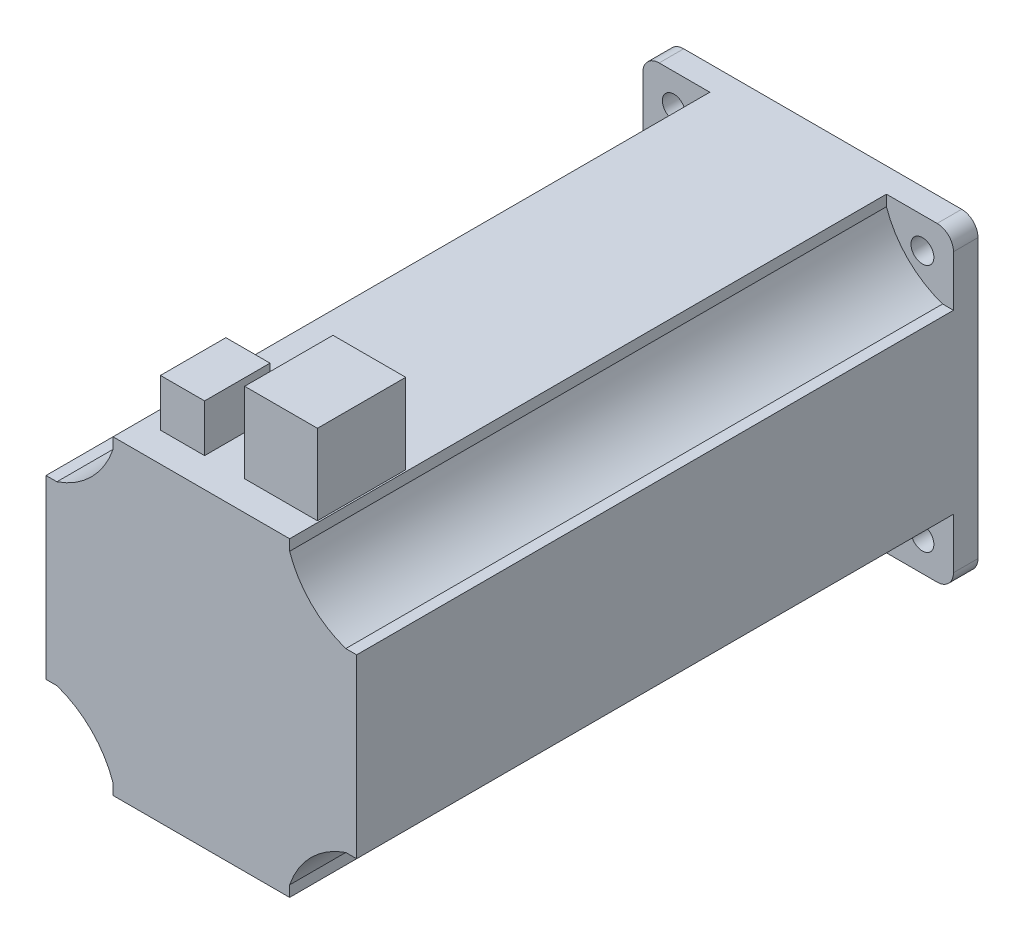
ISO-10303-21;
HEADER;
FILE_DESCRIPTION(('STEP AP214'),'2;1');
FILE_NAME('part.step','',(''),(''),'','','');
FILE_SCHEMA(('AUTOMOTIVE_DESIGN { 1 0 10303 214 1 1 1 1 }'));
ENDSEC;
DATA;
#1=APPLICATION_CONTEXT('core data for automotive mechanical design processes');
#2=APPLICATION_PROTOCOL_DEFINITION('international standard','automotive_design',2000,#1);
#3=PRODUCT_CONTEXT('',#1,'mechanical');
#4=PRODUCT('Part','Part','',(#3));
#5=PRODUCT_RELATED_PRODUCT_CATEGORY('part','',(#4));
#6=PRODUCT_DEFINITION_FORMATION('','',#4);
#7=PRODUCT_DEFINITION_CONTEXT('part definition',#1,'design');
#8=PRODUCT_DEFINITION('design','',#6,#7);
#9=PRODUCT_DEFINITION_SHAPE('','',#8);
#10=(LENGTH_UNIT() NAMED_UNIT(*) SI_UNIT(.MILLI.,.METRE.));
#11=(NAMED_UNIT(*) PLANE_ANGLE_UNIT() SI_UNIT($,.RADIAN.));
#12=(NAMED_UNIT(*) SI_UNIT($,.STERADIAN.) SOLID_ANGLE_UNIT());
#13=UNCERTAINTY_MEASURE_WITH_UNIT(LENGTH_MEASURE(1.E-05),#10,'distance_accuracy_value','');
#14=(GEOMETRIC_REPRESENTATION_CONTEXT(3) GLOBAL_UNCERTAINTY_ASSIGNED_CONTEXT((#13)) GLOBAL_UNIT_ASSIGNED_CONTEXT((#10,
#11,#12)) REPRESENTATION_CONTEXT('',''));
#15=CARTESIAN_POINT('',(0.,0.,0.));
#16=DIRECTION('',(0.,0.,1.));
#17=DIRECTION('',(1.,0.,0.));
#18=AXIS2_PLACEMENT_3D('',#15,#16,#17);
#19=CARTESIAN_POINT('',(-85.,95.,380.));
#20=DIRECTION('',(0.,-1.,0.));
#21=DIRECTION('',(1.,0.,0.));
#22=AXIS2_PLACEMENT_3D('',#19,#20,#21);
#23=PLANE('',#22);
#24=DIRECTION('',(0.,0.,-1.));
#25=VECTOR('',#24,1.);
#26=CARTESIAN_POINT('',(52.9999999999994,95.,308.));
#27=LINE('',#26,#25);
#28=CARTESIAN_POINT('',(52.9999999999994,95.,362.));
#29=VERTEX_POINT('',#28);
#30=CARTESIAN_POINT('',(52.9999999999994,95.,308.));
#31=VERTEX_POINT('',#30);
#32=EDGE_CURVE('E253',#29,#31,#27,.T.);
#33=ORIENTED_EDGE('',*,*,#32,.F.);
#34=DIRECTION('',(1.,0.,0.));
#35=VECTOR('',#34,1.);
#36=CARTESIAN_POINT('',(52.9999999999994,95.,362.));
#37=LINE('',#36,#35);
#38=CARTESIAN_POINT('',(8.49999999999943,95.,362.));
#39=VERTEX_POINT('',#38);
#40=EDGE_CURVE('E262',#39,#29,#37,.T.);
#41=ORIENTED_EDGE('',*,*,#40,.F.);
#42=DIRECTION('',(0.,0.,1.));
#43=VECTOR('',#42,1.);
#44=CARTESIAN_POINT('',(8.49999999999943,95.,308.));
#45=LINE('',#44,#43);
#46=CARTESIAN_POINT('',(8.49999999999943,95.,308.));
#47=VERTEX_POINT('',#46);
#48=EDGE_CURVE('E259',#47,#39,#45,.T.);
#49=ORIENTED_EDGE('',*,*,#48,.F.);
#50=DIRECTION('',(-1.,0.,0.));
#51=VECTOR('',#50,1.);
#52=CARTESIAN_POINT('',(52.9999999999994,95.,308.));
#53=LINE('',#52,#51);
#54=EDGE_CURVE('E256',#31,#47,#53,.T.);
#55=ORIENTED_EDGE('',*,*,#54,.F.);
#56=EDGE_LOOP('',(#33,#41,#49,#55));
#57=FACE_BOUND('',#56,.T.);
#58=DIRECTION('',(0.,0.,-1.));
#59=VECTOR('',#58,1.);
#60=CARTESIAN_POINT('',(53.999999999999,95.,380.));
#61=LINE('',#60,#59);
#62=CARTESIAN_POINT('',(53.999999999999,95.,380.));
#63=VERTEX_POINT('',#62);
#64=CARTESIAN_POINT('',(53.999999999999,95.,15.));
#65=VERTEX_POINT('',#64);
#66=EDGE_CURVE('E314',#63,#65,#61,.T.);
#67=ORIENTED_EDGE('',*,*,#66,.T.);
#68=DIRECTION('',(-1.,0.,0.));
#69=VECTOR('',#68,1.);
#70=CARTESIAN_POINT('',(84.999999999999,95.,15.));
#71=LINE('',#70,#69);
#72=CARTESIAN_POINT('',(84.999999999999,95.,15.));
#73=VERTEX_POINT('',#72);
#74=EDGE_CURVE('E301',#73,#65,#71,.T.);
#75=ORIENTED_EDGE('',*,*,#74,.F.);
#76=DIRECTION('',(0.,0.,-1.));
#77=VECTOR('',#76,1.);
#78=CARTESIAN_POINT('',(85.,95.,380.));
#79=LINE('',#78,#77);
#80=CARTESIAN_POINT('',(85.,95.,0.));
#81=VERTEX_POINT('',#80);
#82=EDGE_CURVE('E463',#73,#81,#79,.T.);
#83=ORIENTED_EDGE('',*,*,#82,.T.);
#84=DIRECTION('',(-1.,0.,0.));
#85=VECTOR('',#84,1.);
#86=CARTESIAN_POINT('',(-85.,95.,0.));
#87=LINE('',#86,#85);
#88=CARTESIAN_POINT('',(-85.,95.,0.));
#89=VERTEX_POINT('',#88);
#90=EDGE_CURVE('E447',#81,#89,#87,.T.);
#91=ORIENTED_EDGE('',*,*,#90,.T.);
#92=DIRECTION('',(0.,0.,-1.));
#93=VECTOR('',#92,1.);
#94=CARTESIAN_POINT('',(-85.,95.,380.));
#95=LINE('',#94,#93);
#96=CARTESIAN_POINT('',(-85.,95.,15.));
#97=VERTEX_POINT('',#96);
#98=EDGE_CURVE('E461',#97,#89,#95,.T.);
#99=ORIENTED_EDGE('',*,*,#98,.F.);
#100=DIRECTION('',(-1.,0.,0.));
#101=VECTOR('',#100,1.);
#102=CARTESIAN_POINT('',(-54.,95.,15.));
#103=LINE('',#102,#101);
#104=CARTESIAN_POINT('',(-54.,95.,15.));
#105=VERTEX_POINT('',#104);
#106=EDGE_CURVE('E390',#105,#97,#103,.T.);
#107=ORIENTED_EDGE('',*,*,#106,.F.);
#108=DIRECTION('',(0.,0.,-1.));
#109=VECTOR('',#108,1.);
#110=CARTESIAN_POINT('',(-54.,95.,380.));
#111=LINE('',#110,#109);
#112=CARTESIAN_POINT('',(-54.,95.,380.));
#113=VERTEX_POINT('',#112);
#114=EDGE_CURVE('E411',#113,#105,#111,.T.);
#115=ORIENTED_EDGE('',*,*,#114,.F.);
#116=DIRECTION('',(-1.,0.,0.));
#117=VECTOR('',#116,1.);
#118=CARTESIAN_POINT('',(-85.,95.,380.));
#119=LINE('',#118,#117);
#120=EDGE_CURVE('E459',#63,#113,#119,.T.);
#121=ORIENTED_EDGE('',*,*,#120,.F.);
#122=EDGE_LOOP('',(#67,#75,#83,#91,#99,#107,#115,#121));
#123=FACE_BOUND('',#122,.T.);
#124=DIRECTION('',(0.,0.,-1.));
#125=VECTOR('',#124,1.);
#126=CARTESIAN_POINT('',(-16.,95.,362.));
#127=LINE('',#126,#125);
#128=CARTESIAN_POINT('',(-16.,95.,362.));
#129=VERTEX_POINT('',#128);
#130=CARTESIAN_POINT('',(-16.,95.,322.));
#131=VERTEX_POINT('',#130);
#132=EDGE_CURVE('E220',#129,#131,#127,.T.);
#133=ORIENTED_EDGE('',*,*,#132,.F.);
#134=DIRECTION('',(1.,0.,0.));
#135=VECTOR('',#134,1.);
#136=CARTESIAN_POINT('',(-16.,95.,362.));
#137=LINE('',#136,#135);
#138=CARTESIAN_POINT('',(-43.,95.,362.));
#139=VERTEX_POINT('',#138);
#140=EDGE_CURVE('E222',#139,#129,#137,.T.);
#141=ORIENTED_EDGE('',*,*,#140,.F.);
#142=DIRECTION('',(0.,0.,1.));
#143=VECTOR('',#142,1.);
#144=CARTESIAN_POINT('',(-43.,95.,362.));
#145=LINE('',#144,#143);
#146=CARTESIAN_POINT('',(-43.,95.,322.));
#147=VERTEX_POINT('',#146);
#148=EDGE_CURVE('E35',#147,#139,#145,.T.);
#149=ORIENTED_EDGE('',*,*,#148,.F.);
#150=DIRECTION('',(-1.,0.,0.));
#151=VECTOR('',#150,1.);
#152=CARTESIAN_POINT('',(-16.,95.,322.));
#153=LINE('',#152,#151);
#154=EDGE_CURVE('E30',#131,#147,#153,.T.);
#155=ORIENTED_EDGE('',*,*,#154,.F.);
#156=EDGE_LOOP('',(#133,#141,#149,#155));
#157=FACE_BOUND('',#156,.T.);
#158=ADVANCED_FACE('F15',(#57,#123,#157),#23,.F.);
#159=CARTESIAN_POINT('',(-85.,85.,380.));
#160=DIRECTION('',(0.,0.,-1.));
#161=DIRECTION('',(-1.,0.,0.));
#162=AXIS2_PLACEMENT_3D('',#159,#160,#161);
#163=PLANE('',#162);
#164=DIRECTION('',(1.,0.,0.));
#165=VECTOR('',#164,1.);
#166=CARTESIAN_POINT('',(88.3423083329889,54.000000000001,380.));
#167=LINE('',#166,#165);
#168=CARTESIAN_POINT('',(88.3423083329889,54.000000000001,380.));
#169=VERTEX_POINT('',#168);
#170=CARTESIAN_POINT('',(95.,54.000000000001,380.));
#171=VERTEX_POINT('',#170);
#172=EDGE_CURVE('E307',#169,#171,#167,.T.);
#173=ORIENTED_EDGE('',*,*,#172,.F.);
#174=CARTESIAN_POINT('',(106.066017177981,106.066017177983,380.));
#175=DIRECTION('',(0.,0.,1.));
#176=DIRECTION('',(0.,-1.,0.));
#177=AXIS2_PLACEMENT_3D('',#174,#175,#176);
#178=CIRCLE('',#177,55.);
#179=CARTESIAN_POINT('',(53.9999999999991,88.34230833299,380.));
#180=VERTEX_POINT('',#179);
#181=EDGE_CURVE('E305',#180,#169,#178,.T.);
#182=ORIENTED_EDGE('',*,*,#181,.F.);
#183=DIRECTION('',(0.,-1.,0.));
#184=VECTOR('',#183,1.);
#185=CARTESIAN_POINT('',(53.9999999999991,88.34230833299,380.));
#186=LINE('',#185,#184);
#187=EDGE_CURVE('E309',#63,#180,#186,.T.);
#188=ORIENTED_EDGE('',*,*,#187,.F.);
#189=ORIENTED_EDGE('',*,*,#120,.T.);
#190=DIRECTION('',(0.,1.,0.));
#191=VECTOR('',#190,1.);
#192=CARTESIAN_POINT('',(-54.,88.3423083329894,380.));
#193=LINE('',#192,#191);
#194=CARTESIAN_POINT('',(-54.,88.3423083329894,380.));
#195=VERTEX_POINT('',#194);
#196=EDGE_CURVE('E400',#195,#113,#193,.T.);
#197=ORIENTED_EDGE('',*,*,#196,.F.);
#198=CARTESIAN_POINT('',(-106.066017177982,106.066017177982,380.));
#199=DIRECTION('',(0.,0.,1.));
#200=DIRECTION('',(1.,0.,0.));
#201=AXIS2_PLACEMENT_3D('',#198,#199,#200);
#202=CIRCLE('',#201,55.);
#203=CARTESIAN_POINT('',(-88.3423083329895,54.,380.));
#204=VERTEX_POINT('',#203);
#205=EDGE_CURVE('E398',#204,#195,#202,.T.);
#206=ORIENTED_EDGE('',*,*,#205,.F.);
#207=DIRECTION('',(1.,0.,0.));
#208=VECTOR('',#207,1.);
#209=CARTESIAN_POINT('',(-88.3423083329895,54.,380.));
#210=LINE('',#209,#208);
#211=CARTESIAN_POINT('',(-95.,54.,380.));
#212=VERTEX_POINT('',#211);
#213=EDGE_CURVE('E403',#212,#204,#210,.T.);
#214=ORIENTED_EDGE('',*,*,#213,.F.);
#215=DIRECTION('',(0.,-1.,0.));
#216=VECTOR('',#215,1.);
#217=CARTESIAN_POINT('',(-95.,85.,380.));
#218=LINE('',#217,#216);
#219=CARTESIAN_POINT('',(-95.,-54.,380.));
#220=VERTEX_POINT('',#219);
#221=EDGE_CURVE('E450',#212,#220,#218,.T.);
#222=ORIENTED_EDGE('',*,*,#221,.T.);
#223=DIRECTION('',(-1.,0.,0.));
#224=VECTOR('',#223,1.);
#225=CARTESIAN_POINT('',(-88.3423083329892,-54.,380.));
#226=LINE('',#225,#224);
#227=CARTESIAN_POINT('',(-88.3423083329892,-54.,380.));
#228=VERTEX_POINT('',#227);
#229=EDGE_CURVE('E369',#228,#220,#226,.T.);
#230=ORIENTED_EDGE('',*,*,#229,.F.);
#231=CARTESIAN_POINT('',(-106.066017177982,-106.066017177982,380.));
#232=DIRECTION('',(0.,0.,1.));
#233=DIRECTION('',(0.,1.,0.));
#234=AXIS2_PLACEMENT_3D('',#231,#232,#233);
#235=CIRCLE('',#234,55.);
#236=CARTESIAN_POINT('',(-54.,-88.3423083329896,380.));
#237=VERTEX_POINT('',#236);
#238=EDGE_CURVE('E367',#237,#228,#235,.T.);
#239=ORIENTED_EDGE('',*,*,#238,.F.);
#240=DIRECTION('',(0.,1.,0.));
#241=VECTOR('',#240,1.);
#242=CARTESIAN_POINT('',(-54.,-88.3423083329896,380.));
#243=LINE('',#242,#241);
#244=CARTESIAN_POINT('',(-54.,-95.,380.));
#245=VERTEX_POINT('',#244);
#246=EDGE_CURVE('E371',#245,#237,#243,.T.);
#247=ORIENTED_EDGE('',*,*,#246,.F.);
#248=DIRECTION('',(1.,0.,0.));
#249=VECTOR('',#248,1.);
#250=CARTESIAN_POINT('',(-85.,-95.,380.));
#251=LINE('',#250,#249);
#252=CARTESIAN_POINT('',(54.0000000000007,-95.,380.));
#253=VERTEX_POINT('',#252);
#254=EDGE_CURVE('E453',#245,#253,#251,.T.);
#255=ORIENTED_EDGE('',*,*,#254,.T.);
#256=DIRECTION('',(0.,-1.,0.));
#257=VECTOR('',#256,1.);
#258=CARTESIAN_POINT('',(54.0000000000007,-88.3423083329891,380.));
#259=LINE('',#258,#257);
#260=CARTESIAN_POINT('',(54.0000000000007,-88.3423083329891,380.));
#261=VERTEX_POINT('',#260);
#262=EDGE_CURVE('E338',#261,#253,#259,.T.);
#263=ORIENTED_EDGE('',*,*,#262,.F.);
#264=CARTESIAN_POINT('',(106.066017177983,-106.066017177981,380.));
#265=DIRECTION('',(0.,0.,1.));
#266=DIRECTION('',(-1.,0.,0.));
#267=AXIS2_PLACEMENT_3D('',#264,#265,#266);
#268=CIRCLE('',#267,55.);
#269=CARTESIAN_POINT('',(88.3423083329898,-53.9999999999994,380.));
#270=VERTEX_POINT('',#269);
#271=EDGE_CURVE('E336',#270,#261,#268,.T.);
#272=ORIENTED_EDGE('',*,*,#271,.F.);
#273=DIRECTION('',(-1.,0.,0.));
#274=VECTOR('',#273,1.);
#275=CARTESIAN_POINT('',(88.3423083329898,-53.9999999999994,380.));
#276=LINE('',#275,#274);
#277=CARTESIAN_POINT('',(95.,-53.9999999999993,380.));
#278=VERTEX_POINT('',#277);
#279=EDGE_CURVE('E340',#278,#270,#276,.T.);
#280=ORIENTED_EDGE('',*,*,#279,.F.);
#281=DIRECTION('',(0.,1.,0.));
#282=VECTOR('',#281,1.);
#283=CARTESIAN_POINT('',(95.,85.,380.));
#284=LINE('',#283,#282);
#285=EDGE_CURVE('E456',#278,#171,#284,.T.);
#286=ORIENTED_EDGE('',*,*,#285,.T.);
#287=EDGE_LOOP('',(#173,#182,#188,#189,#197,#206,#214,#222,#230,#239,#247,#255,#263,#272,#280,#286));
#288=FACE_BOUND('',#287,.T.);
#289=ADVANCED_FACE('F533',(#288),#163,.F.);
#290=CARTESIAN_POINT('',(95.,85.,380.));
#291=DIRECTION('',(-1.,0.,0.));
#292=DIRECTION('',(0.,-1.,0.));
#293=AXIS2_PLACEMENT_3D('',#290,#291,#292);
#294=PLANE('',#293);
#295=DIRECTION('',(0.,0.,-1.));
#296=VECTOR('',#295,1.);
#297=CARTESIAN_POINT('',(95.,54.000000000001,380.));
#298=LINE('',#297,#296);
#299=CARTESIAN_POINT('',(95.,54.000000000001,15.));
#300=VERTEX_POINT('',#299);
#301=EDGE_CURVE('E317',#171,#300,#298,.T.);
#302=ORIENTED_EDGE('',*,*,#301,.F.);
#303=ORIENTED_EDGE('',*,*,#285,.F.);
#304=DIRECTION('',(0.,0.,-1.));
#305=VECTOR('',#304,1.);
#306=CARTESIAN_POINT('',(95.,-53.9999999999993,380.));
#307=LINE('',#306,#305);
#308=CARTESIAN_POINT('',(95.,-53.9999999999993,15.));
#309=VERTEX_POINT('',#308);
#310=EDGE_CURVE('E345',#278,#309,#307,.T.);
#311=ORIENTED_EDGE('',*,*,#310,.T.);
#312=DIRECTION('',(0.,1.,0.));
#313=VECTOR('',#312,1.);
#314=CARTESIAN_POINT('',(95.,-85.,15.));
#315=LINE('',#314,#313);
#316=CARTESIAN_POINT('',(95.,-85.,15.));
#317=VERTEX_POINT('',#316);
#318=EDGE_CURVE('E332',#317,#309,#315,.T.);
#319=ORIENTED_EDGE('',*,*,#318,.F.);
#320=DIRECTION('',(0.,0.,-1.));
#321=VECTOR('',#320,1.);
#322=CARTESIAN_POINT('',(95.,-85.,380.));
#323=LINE('',#322,#321);
#324=CARTESIAN_POINT('',(95.,-85.,0.));
#325=VERTEX_POINT('',#324);
#326=EDGE_CURVE('E467',#317,#325,#323,.T.);
#327=ORIENTED_EDGE('',*,*,#326,.T.);
#328=DIRECTION('',(0.,1.,0.));
#329=VECTOR('',#328,1.);
#330=CARTESIAN_POINT('',(95.,85.,0.));
#331=LINE('',#330,#329);
#332=CARTESIAN_POINT('',(95.,85.,0.));
#333=VERTEX_POINT('',#332);
#334=EDGE_CURVE('E441',#325,#333,#331,.T.);
#335=ORIENTED_EDGE('',*,*,#334,.T.);
#336=DIRECTION('',(0.,0.,-1.));
#337=VECTOR('',#336,1.);
#338=CARTESIAN_POINT('',(95.,85.,380.));
#339=LINE('',#338,#337);
#340=CARTESIAN_POINT('',(95.,85.,15.));
#341=VERTEX_POINT('',#340);
#342=EDGE_CURVE('E465',#341,#333,#339,.T.);
#343=ORIENTED_EDGE('',*,*,#342,.F.);
#344=DIRECTION('',(0.,1.,0.));
#345=VECTOR('',#344,1.);
#346=CARTESIAN_POINT('',(95.,54.000000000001,15.));
#347=LINE('',#346,#345);
#348=EDGE_CURVE('E297',#300,#341,#347,.T.);
#349=ORIENTED_EDGE('',*,*,#348,.F.);
#350=EDGE_LOOP('',(#302,#303,#311,#319,#327,#335,#343,#349));
#351=FACE_BOUND('',#350,.T.);
#352=ADVANCED_FACE('F505',(#351),#294,.F.);
#353=CARTESIAN_POINT('',(85.,85.,380.));
#354=DIRECTION('',(0.,0.,-1.));
#355=DIRECTION('',(-1.,0.,0.));
#356=AXIS2_PLACEMENT_3D('',#353,#354,#355);
#357=CYLINDRICAL_SURFACE('',#356,10.);
#358=CARTESIAN_POINT('',(84.9999999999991,85.,15.));
#359=DIRECTION('',(0.,0.,1.));
#360=DIRECTION('',(0.,-1.,0.));
#361=AXIS2_PLACEMENT_3D('',#358,#359,#360);
#362=CIRCLE('',#361,10.);
#363=EDGE_CURVE('E299',#341,#73,#362,.T.);
#364=ORIENTED_EDGE('',*,*,#363,.F.);
#365=ORIENTED_EDGE('',*,*,#342,.T.);
#366=CARTESIAN_POINT('',(85.,85.,0.));
#367=DIRECTION('',(0.,0.,1.));
#368=DIRECTION('',(-1.,0.,0.));
#369=AXIS2_PLACEMENT_3D('',#366,#367,#368);
#370=CIRCLE('',#369,10.);
#371=EDGE_CURVE('E444',#333,#81,#370,.T.);
#372=ORIENTED_EDGE('',*,*,#371,.T.);
#373=ORIENTED_EDGE('',*,*,#82,.F.);
#374=EDGE_LOOP('',(#364,#365,#372,#373));
#375=FACE_BOUND('',#374,.T.);
#376=ADVANCED_FACE('F500',(#375),#357,.T.);
#377=CARTESIAN_POINT('',(-85.,-95.,380.));
#378=DIRECTION('',(0.,1.,0.));
#379=DIRECTION('',(-1.,0.,0.));
#380=AXIS2_PLACEMENT_3D('',#377,#378,#379);
#381=PLANE('',#380);
#382=DIRECTION('',(0.,0.,-1.));
#383=VECTOR('',#382,1.);
#384=CARTESIAN_POINT('',(54.0000000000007,-95.,380.));
#385=LINE('',#384,#383);
#386=CARTESIAN_POINT('',(54.0000000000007,-95.,15.));
#387=VERTEX_POINT('',#386);
#388=EDGE_CURVE('E348',#253,#387,#385,.T.);
#389=ORIENTED_EDGE('',*,*,#388,.F.);
#390=ORIENTED_EDGE('',*,*,#254,.F.);
#391=DIRECTION('',(0.,0.,-1.));
#392=VECTOR('',#391,1.);
#393=CARTESIAN_POINT('',(-54.,-95.,380.));
#394=LINE('',#393,#392);
#395=CARTESIAN_POINT('',(-54.,-95.,15.));
#396=VERTEX_POINT('',#395);
#397=EDGE_CURVE('E376',#245,#396,#394,.T.);
#398=ORIENTED_EDGE('',*,*,#397,.T.);
#399=DIRECTION('',(1.,0.,0.));
#400=VECTOR('',#399,1.);
#401=CARTESIAN_POINT('',(-85.,-95.,15.));
#402=LINE('',#401,#400);
#403=CARTESIAN_POINT('',(-85.,-95.,15.));
#404=VERTEX_POINT('',#403);
#405=EDGE_CURVE('E363',#404,#396,#402,.T.);
#406=ORIENTED_EDGE('',*,*,#405,.F.);
#407=DIRECTION('',(0.,0.,-1.));
#408=VECTOR('',#407,1.);
#409=CARTESIAN_POINT('',(-85.,-95.,380.));
#410=LINE('',#409,#408);
#411=CARTESIAN_POINT('',(-85.,-95.,0.));
#412=VERTEX_POINT('',#411);
#413=EDGE_CURVE('E471',#404,#412,#410,.T.);
#414=ORIENTED_EDGE('',*,*,#413,.T.);
#415=DIRECTION('',(1.,0.,0.));
#416=VECTOR('',#415,1.);
#417=CARTESIAN_POINT('',(-85.,-95.,0.));
#418=LINE('',#417,#416);
#419=CARTESIAN_POINT('',(85.,-95.,0.));
#420=VERTEX_POINT('',#419);
#421=EDGE_CURVE('E435',#412,#420,#418,.T.);
#422=ORIENTED_EDGE('',*,*,#421,.T.);
#423=DIRECTION('',(0.,0.,-1.));
#424=VECTOR('',#423,1.);
#425=CARTESIAN_POINT('',(85.,-95.,380.));
#426=LINE('',#425,#424);
#427=CARTESIAN_POINT('',(85.,-95.,15.));
#428=VERTEX_POINT('',#427);
#429=EDGE_CURVE('E469',#428,#420,#426,.T.);
#430=ORIENTED_EDGE('',*,*,#429,.F.);
#431=DIRECTION('',(1.,0.,0.));
#432=VECTOR('',#431,1.);
#433=CARTESIAN_POINT('',(54.0000000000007,-95.,15.));
#434=LINE('',#433,#432);
#435=EDGE_CURVE('E328',#387,#428,#434,.T.);
#436=ORIENTED_EDGE('',*,*,#435,.F.);
#437=EDGE_LOOP('',(#389,#390,#398,#406,#414,#422,#430,#436));
#438=FACE_BOUND('',#437,.T.);
#439=ADVANCED_FACE('F514',(#438),#381,.F.);
#440=CARTESIAN_POINT('',(85.,-85.,380.));
#441=DIRECTION('',(0.,0.,-1.));
#442=DIRECTION('',(-1.,0.,0.));
#443=AXIS2_PLACEMENT_3D('',#440,#441,#442);
#444=CYLINDRICAL_SURFACE('',#443,10.);
#445=CARTESIAN_POINT('',(85.,-85.,15.));
#446=DIRECTION('',(0.,0.,1.));
#447=DIRECTION('',(-1.,0.,0.));
#448=AXIS2_PLACEMENT_3D('',#445,#446,#447);
#449=CIRCLE('',#448,10.);
#450=EDGE_CURVE('E330',#428,#317,#449,.T.);
#451=ORIENTED_EDGE('',*,*,#450,.F.);
#452=ORIENTED_EDGE('',*,*,#429,.T.);
#453=CARTESIAN_POINT('',(85.,-85.,0.));
#454=DIRECTION('',(0.,0.,1.));
#455=DIRECTION('',(-1.,0.,0.));
#456=AXIS2_PLACEMENT_3D('',#453,#454,#455);
#457=CIRCLE('',#456,10.);
#458=EDGE_CURVE('E438',#420,#325,#457,.T.);
#459=ORIENTED_EDGE('',*,*,#458,.T.);
#460=ORIENTED_EDGE('',*,*,#326,.F.);
#461=EDGE_LOOP('',(#451,#452,#459,#460));
#462=FACE_BOUND('',#461,.T.);
#463=ADVANCED_FACE('F510',(#462),#444,.T.);
#464=CARTESIAN_POINT('',(-95.,85.,380.));
#465=DIRECTION('',(1.,0.,0.));
#466=DIRECTION('',(0.,0.,-1.));
#467=AXIS2_PLACEMENT_3D('',#464,#465,#466);
#468=PLANE('',#467);
#469=DIRECTION('',(0.,0.,-1.));
#470=VECTOR('',#469,1.);
#471=CARTESIAN_POINT('',(-95.,-54.,380.));
#472=LINE('',#471,#470);
#473=CARTESIAN_POINT('',(-95.,-54.,15.));
#474=VERTEX_POINT('',#473);
#475=EDGE_CURVE('E379',#220,#474,#472,.T.);
#476=ORIENTED_EDGE('',*,*,#475,.F.);
#477=ORIENTED_EDGE('',*,*,#221,.F.);
#478=DIRECTION('',(0.,0.,-1.));
#479=VECTOR('',#478,1.);
#480=CARTESIAN_POINT('',(-95.,54.,380.));
#481=LINE('',#480,#479);
#482=CARTESIAN_POINT('',(-95.,54.,15.));
#483=VERTEX_POINT('',#482);
#484=EDGE_CURVE('E408',#212,#483,#481,.T.);
#485=ORIENTED_EDGE('',*,*,#484,.T.);
#486=DIRECTION('',(0.,-1.,0.));
#487=VECTOR('',#486,1.);
#488=CARTESIAN_POINT('',(-95.,85.,15.));
#489=LINE('',#488,#487);
#490=CARTESIAN_POINT('',(-95.,85.,15.));
#491=VERTEX_POINT('',#490);
#492=EDGE_CURVE('E394',#491,#483,#489,.T.);
#493=ORIENTED_EDGE('',*,*,#492,.F.);
#494=DIRECTION('',(0.,0.,-1.));
#495=VECTOR('',#494,1.);
#496=CARTESIAN_POINT('',(-95.,85.,380.));
#497=LINE('',#496,#495);
#498=CARTESIAN_POINT('',(-95.,85.,0.));
#499=VERTEX_POINT('',#498);
#500=EDGE_CURVE('E23',#491,#499,#497,.T.);
#501=ORIENTED_EDGE('',*,*,#500,.T.);
#502=DIRECTION('',(0.,-1.,0.));
#503=VECTOR('',#502,1.);
#504=CARTESIAN_POINT('',(-95.,85.,0.));
#505=LINE('',#504,#503);
#506=CARTESIAN_POINT('',(-95.,-85.,0.));
#507=VERTEX_POINT('',#506);
#508=EDGE_CURVE('E429',#499,#507,#505,.T.);
#509=ORIENTED_EDGE('',*,*,#508,.T.);
#510=DIRECTION('',(0.,0.,-1.));
#511=VECTOR('',#510,1.);
#512=CARTESIAN_POINT('',(-95.,-85.,380.));
#513=LINE('',#512,#511);
#514=CARTESIAN_POINT('',(-95.,-85.,15.));
#515=VERTEX_POINT('',#514);
#516=EDGE_CURVE('E473',#515,#507,#513,.T.);
#517=ORIENTED_EDGE('',*,*,#516,.F.);
#518=DIRECTION('',(0.,-1.,0.));
#519=VECTOR('',#518,1.);
#520=CARTESIAN_POINT('',(-95.,-54.,15.));
#521=LINE('',#520,#519);
#522=EDGE_CURVE('E359',#474,#515,#521,.T.);
#523=ORIENTED_EDGE('',*,*,#522,.F.);
#524=EDGE_LOOP('',(#476,#477,#485,#493,#501,#509,#517,#523));
#525=FACE_BOUND('',#524,.T.);
#526=ADVANCED_FACE('F479',(#525),#468,.F.);
#527=CARTESIAN_POINT('',(-85.,-85.,380.));
#528=DIRECTION('',(0.,0.,-1.));
#529=DIRECTION('',(-1.,0.,0.));
#530=AXIS2_PLACEMENT_3D('',#527,#528,#529);
#531=CYLINDRICAL_SURFACE('',#530,10.);
#532=CARTESIAN_POINT('',(-85.,-85.,15.));
#533=DIRECTION('',(0.,0.,1.));
#534=DIRECTION('',(0.,1.,0.));
#535=AXIS2_PLACEMENT_3D('',#532,#533,#534);
#536=CIRCLE('',#535,10.);
#537=EDGE_CURVE('E361',#515,#404,#536,.T.);
#538=ORIENTED_EDGE('',*,*,#537,.F.);
#539=ORIENTED_EDGE('',*,*,#516,.T.);
#540=CARTESIAN_POINT('',(-85.,-85.,0.));
#541=DIRECTION('',(0.,0.,1.));
#542=DIRECTION('',(-1.,0.,0.));
#543=AXIS2_PLACEMENT_3D('',#540,#541,#542);
#544=CIRCLE('',#543,10.);
#545=EDGE_CURVE('E432',#507,#412,#544,.T.);
#546=ORIENTED_EDGE('',*,*,#545,.T.);
#547=ORIENTED_EDGE('',*,*,#413,.F.);
#548=EDGE_LOOP('',(#538,#539,#546,#547));
#549=FACE_BOUND('',#548,.T.);
#550=ADVANCED_FACE('F520',(#549),#531,.T.);
#551=CARTESIAN_POINT('',(-85.,85.,380.));
#552=DIRECTION('',(0.,0.,-1.));
#553=DIRECTION('',(-1.,0.,0.));
#554=AXIS2_PLACEMENT_3D('',#551,#552,#553);
#555=CYLINDRICAL_SURFACE('',#554,10.);
#556=CARTESIAN_POINT('',(-85.,85.,15.));
#557=DIRECTION('',(0.,0.,1.));
#558=DIRECTION('',(1.,0.,0.));
#559=AXIS2_PLACEMENT_3D('',#556,#557,#558);
#560=CIRCLE('',#559,10.);
#561=EDGE_CURVE('E392',#97,#491,#560,.T.);
#562=ORIENTED_EDGE('',*,*,#561,.F.);
#563=ORIENTED_EDGE('',*,*,#98,.T.);
#564=CARTESIAN_POINT('',(-85.,85.,0.));
#565=DIRECTION('',(0.,0.,1.));
#566=DIRECTION('',(-1.,0.,0.));
#567=AXIS2_PLACEMENT_3D('',#564,#565,#566);
#568=CIRCLE('',#567,10.);
#569=EDGE_CURVE('E426',#89,#499,#568,.T.);
#570=ORIENTED_EDGE('',*,*,#569,.T.);
#571=ORIENTED_EDGE('',*,*,#500,.F.);
#572=EDGE_LOOP('',(#562,#563,#570,#571));
#573=FACE_BOUND('',#572,.T.);
#574=ADVANCED_FACE('F17',(#573),#555,.T.);
#575=CARTESIAN_POINT('',(-85.,85.,0.));
#576=DIRECTION('',(0.,0.,-1.));
#577=DIRECTION('',(-1.,0.,0.));
#578=AXIS2_PLACEMENT_3D('',#575,#576,#577);
#579=PLANE('',#578);
#580=CARTESIAN_POINT('',(0.,0.,0.));
#581=DIRECTION('',(0.,0.,-1.));
#582=DIRECTION('',(-1.,0.,0.));
#583=AXIS2_PLACEMENT_3D('',#580,#581,#582);
#584=CIRCLE('',#583,75.);
#585=CARTESIAN_POINT('',(-75.,0.,0.));
#586=VERTEX_POINT('',#585);
#587=EDGE_CURVE('E10',#586,#586,#584,.F.);
#588=ORIENTED_EDGE('',*,*,#587,.F.);
#589=EDGE_LOOP('',(#588));
#590=FACE_BOUND('',#589,.T.);
#591=ADVANCED_FACE('F637',(#590),#579,.T.);
#592=CARTESIAN_POINT('',(76.0139789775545,-76.0139789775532,0.));
#593=DIRECTION('',(0.,0.,-1.));
#594=DIRECTION('',(-1.,0.,0.));
#595=AXIS2_PLACEMENT_3D('',#592,#593,#594);
#596=CIRCLE('',#595,7.);
#597=CARTESIAN_POINT('',(69.0139789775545,-76.0139789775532,0.));
#598=VERTEX_POINT('',#597);
#599=EDGE_CURVE('E947',#598,#598,#596,.T.);
#600=ORIENTED_EDGE('',*,*,#599,.F.);
#601=EDGE_LOOP('',(#600));
#602=FACE_BOUND('',#601,.T.);
#603=CARTESIAN_POINT('',(-76.0139789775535,-76.0139789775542,0.));
#604=DIRECTION('',(0.,0.,-1.));
#605=DIRECTION('',(-1.,0.,0.));
#606=AXIS2_PLACEMENT_3D('',#603,#604,#605);
#607=CIRCLE('',#606,7.);
#608=CARTESIAN_POINT('',(-83.0139789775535,-76.0139789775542,0.));
#609=VERTEX_POINT('',#608);
#610=EDGE_CURVE('E951',#609,#609,#607,.T.);
#611=ORIENTED_EDGE('',*,*,#610,.F.);
#612=EDGE_LOOP('',(#611));
#613=FACE_BOUND('',#612,.T.);
#614=CARTESIAN_POINT('',(-76.013978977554,76.0139789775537,0.));
#615=DIRECTION('',(0.,0.,-1.));
#616=DIRECTION('',(-1.,0.,0.));
#617=AXIS2_PLACEMENT_3D('',#614,#615,#616);
#618=CIRCLE('',#617,7.);
#619=CARTESIAN_POINT('',(-83.013978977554,76.0139789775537,0.));
#620=VERTEX_POINT('',#619);
#621=EDGE_CURVE('E960',#620,#620,#618,.T.);
#622=ORIENTED_EDGE('',*,*,#621,.F.);
#623=EDGE_LOOP('',(#622));
#624=FACE_BOUND('',#623,.T.);
#625=CARTESIAN_POINT('',(76.013978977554,76.0139789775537,0.));
#626=DIRECTION('',(0.,0.,-1.));
#627=DIRECTION('',(-1.,0.,0.));
#628=AXIS2_PLACEMENT_3D('',#625,#626,#627);
#629=CIRCLE('',#628,7.);
#630=CARTESIAN_POINT('',(69.013978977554,76.0139789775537,0.));
#631=VERTEX_POINT('',#630);
#632=EDGE_CURVE('E286',#631,#631,#629,.T.);
#633=ORIENTED_EDGE('',*,*,#632,.F.);
#634=EDGE_LOOP('',(#633));
#635=FACE_BOUND('',#634,.T.);
#636=ORIENTED_EDGE('',*,*,#569,.F.);
#637=ORIENTED_EDGE('',*,*,#90,.F.);
#638=ORIENTED_EDGE('',*,*,#371,.F.);
#639=ORIENTED_EDGE('',*,*,#334,.F.);
#640=ORIENTED_EDGE('',*,*,#458,.F.);
#641=ORIENTED_EDGE('',*,*,#421,.F.);
#642=ORIENTED_EDGE('',*,*,#545,.F.);
#643=ORIENTED_EDGE('',*,*,#508,.F.);
#644=EDGE_LOOP('',(#636,#637,#638,#639,#640,#641,#642,#643));
#645=FACE_BOUND('',#644,.T.);
#646=CARTESIAN_POINT('',(0.,0.,0.));
#647=DIRECTION('',(0.,0.,-1.));
#648=DIRECTION('',(-1.,0.,0.));
#649=AXIS2_PLACEMENT_3D('',#646,#647,#648);
#650=CIRCLE('',#649,80.);
#651=CARTESIAN_POINT('',(-80.,0.,0.));
#652=VERTEX_POINT('',#651);
#653=EDGE_CURVE('E420',#652,#652,#650,.T.);
#654=ORIENTED_EDGE('',*,*,#653,.F.);
#655=EDGE_LOOP('',(#654));
#656=FACE_BOUND('',#655,.T.);
#657=ADVANCED_FACE('F486',(#602,#613,#624,#635,#645,#656),#579,.T.);
#658=CARTESIAN_POINT('',(0.,0.,-5.));
#659=DIRECTION('',(0.,0.,-1.));
#660=DIRECTION('',(-1.,0.,0.));
#661=AXIS2_PLACEMENT_3D('',#658,#659,#660);
#662=PLANE('',#661);
#663=CARTESIAN_POINT('',(0.,0.,-5.));
#664=DIRECTION('',(0.,0.,-1.));
#665=DIRECTION('',(-1.,0.,0.));
#666=AXIS2_PLACEMENT_3D('',#663,#664,#665);
#667=CIRCLE('',#666,80.);
#668=CARTESIAN_POINT('',(-80.,0.,-5.));
#669=VERTEX_POINT('',#668);
#670=EDGE_CURVE('E423',#669,#669,#667,.T.);
#671=ORIENTED_EDGE('',*,*,#670,.T.);
#672=EDGE_LOOP('',(#671));
#673=FACE_BOUND('',#672,.T.);
#674=CARTESIAN_POINT('',(0.,0.,-5.));
#675=DIRECTION('',(0.,0.,-1.));
#676=DIRECTION('',(-1.,0.,0.));
#677=AXIS2_PLACEMENT_3D('',#674,#675,#676);
#678=CIRCLE('',#677,75.);
#679=CARTESIAN_POINT('',(-75.,0.,-5.));
#680=VERTEX_POINT('',#679);
#681=EDGE_CURVE('E417',#680,#680,#678,.T.);
#682=ORIENTED_EDGE('',*,*,#681,.F.);
#683=EDGE_LOOP('',(#682));
#684=FACE_BOUND('',#683,.T.);
#685=ADVANCED_FACE('F651',(#673,#684),#662,.T.);
#686=CARTESIAN_POINT('',(0.,0.,-5.));
#687=DIRECTION('',(0.,0.,1.));
#688=DIRECTION('',(1.,0.,0.));
#689=AXIS2_PLACEMENT_3D('',#686,#687,#688);
#690=CYLINDRICAL_SURFACE('',#689,80.);
#691=ORIENTED_EDGE('',*,*,#670,.F.);
#692=EDGE_LOOP('',(#691));
#693=FACE_BOUND('',#692,.T.);
#694=ORIENTED_EDGE('',*,*,#653,.T.);
#695=EDGE_LOOP('',(#694));
#696=FACE_BOUND('',#695,.T.);
#697=ADVANCED_FACE('F659',(#693,#696),#690,.T.);
#698=CARTESIAN_POINT('',(0.,0.,-5.));
#699=DIRECTION('',(0.,0.,1.));
#700=DIRECTION('',(1.,0.,0.));
#701=AXIS2_PLACEMENT_3D('',#698,#699,#700);
#702=CYLINDRICAL_SURFACE('',#701,75.);
#703=ORIENTED_EDGE('',*,*,#681,.T.);
#704=EDGE_LOOP('',(#703));
#705=FACE_BOUND('',#704,.T.);
#706=ORIENTED_EDGE('',*,*,#587,.T.);
#707=EDGE_LOOP('',(#706));
#708=FACE_BOUND('',#707,.T.);
#709=ADVANCED_FACE('F668',(#705,#708),#702,.F.);
#710=CARTESIAN_POINT('',(-106.066017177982,106.066017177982,380.));
#711=DIRECTION('',(0.,0.,-1.));
#712=DIRECTION('',(-1.,0.,0.));
#713=AXIS2_PLACEMENT_3D('',#710,#711,#712);
#714=CYLINDRICAL_SURFACE('',#713,55.);
#715=CARTESIAN_POINT('',(-106.066017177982,106.066017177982,15.));
#716=DIRECTION('',(0.,0.,1.));
#717=DIRECTION('',(1.,0.,0.));
#718=AXIS2_PLACEMENT_3D('',#715,#716,#717);
#719=CIRCLE('',#718,55.);
#720=CARTESIAN_POINT('',(-88.3423083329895,54.,15.));
#721=VERTEX_POINT('',#720);
#722=CARTESIAN_POINT('',(-54.,88.3423083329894,15.));
#723=VERTEX_POINT('',#722);
#724=EDGE_CURVE('E385',#721,#723,#719,.T.);
#725=ORIENTED_EDGE('',*,*,#724,.F.);
#726=DIRECTION('',(0.,0.,-1.));
#727=VECTOR('',#726,1.);
#728=CARTESIAN_POINT('',(-88.3423083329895,54.,380.));
#729=LINE('',#728,#727);
#730=EDGE_CURVE('E405',#204,#721,#729,.T.);
#731=ORIENTED_EDGE('',*,*,#730,.F.);
#732=ORIENTED_EDGE('',*,*,#205,.T.);
#733=DIRECTION('',(0.,0.,-1.));
#734=VECTOR('',#733,1.);
#735=CARTESIAN_POINT('',(-54.,88.3423083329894,380.));
#736=LINE('',#735,#734);
#737=EDGE_CURVE('E414',#195,#723,#736,.T.);
#738=ORIENTED_EDGE('',*,*,#737,.T.);
#739=EDGE_LOOP('',(#725,#731,#732,#738));
#740=FACE_BOUND('',#739,.T.);
#741=ADVANCED_FACE('F677',(#740),#714,.F.);
#742=CARTESIAN_POINT('',(-54.,88.3423083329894,380.));
#743=DIRECTION('',(-1.,0.,0.));
#744=DIRECTION('',(0.,0.,1.));
#745=AXIS2_PLACEMENT_3D('',#742,#743,#744);
#746=PLANE('',#745);
#747=DIRECTION('',(0.,1.,0.));
#748=VECTOR('',#747,1.);
#749=CARTESIAN_POINT('',(-54.,88.3423083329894,15.));
#750=LINE('',#749,#748);
#751=EDGE_CURVE('E388',#723,#105,#750,.T.);
#752=ORIENTED_EDGE('',*,*,#751,.F.);
#753=ORIENTED_EDGE('',*,*,#737,.F.);
#754=ORIENTED_EDGE('',*,*,#196,.T.);
#755=ORIENTED_EDGE('',*,*,#114,.T.);
#756=EDGE_LOOP('',(#752,#753,#754,#755));
#757=FACE_BOUND('',#756,.T.);
#758=ADVANCED_FACE('F547',(#757),#746,.T.);
#759=CARTESIAN_POINT('',(-88.3423083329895,54.,380.));
#760=DIRECTION('',(0.,1.,0.));
#761=DIRECTION('',(0.,0.,1.));
#762=AXIS2_PLACEMENT_3D('',#759,#760,#761);
#763=PLANE('',#762);
#764=DIRECTION('',(1.,0.,0.));
#765=VECTOR('',#764,1.);
#766=CARTESIAN_POINT('',(-88.3423083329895,54.,15.));
#767=LINE('',#766,#765);
#768=EDGE_CURVE('E396',#483,#721,#767,.T.);
#769=ORIENTED_EDGE('',*,*,#768,.F.);
#770=ORIENTED_EDGE('',*,*,#484,.F.);
#771=ORIENTED_EDGE('',*,*,#213,.T.);
#772=ORIENTED_EDGE('',*,*,#730,.T.);
#773=EDGE_LOOP('',(#769,#770,#771,#772));
#774=FACE_BOUND('',#773,.T.);
#775=ADVANCED_FACE('F539',(#774),#763,.T.);
#776=CARTESIAN_POINT('',(-106.066017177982,106.066017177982,15.));
#777=DIRECTION('',(0.,0.,1.));
#778=DIRECTION('',(1.,0.,0.));
#779=AXIS2_PLACEMENT_3D('',#776,#777,#778);
#780=PLANE('',#779);
#781=CARTESIAN_POINT('',(-76.013978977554,76.0139789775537,15.));
#782=DIRECTION('',(0.,0.,1.));
#783=DIRECTION('',(1.,0.,0.));
#784=AXIS2_PLACEMENT_3D('',#781,#782,#783);
#785=CIRCLE('',#784,7.);
#786=CARTESIAN_POINT('',(-69.013978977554,76.0139789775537,15.));
#787=VERTEX_POINT('',#786);
#788=EDGE_CURVE('E226',#787,#787,#785,.T.);
#789=ORIENTED_EDGE('',*,*,#788,.F.);
#790=EDGE_LOOP('',(#789));
#791=FACE_BOUND('',#790,.T.);
#792=ORIENTED_EDGE('',*,*,#724,.T.);
#793=ORIENTED_EDGE('',*,*,#751,.T.);
#794=ORIENTED_EDGE('',*,*,#106,.T.);
#795=ORIENTED_EDGE('',*,*,#561,.T.);
#796=ORIENTED_EDGE('',*,*,#492,.T.);
#797=ORIENTED_EDGE('',*,*,#768,.T.);
#798=EDGE_LOOP('',(#792,#793,#794,#795,#796,#797));
#799=FACE_BOUND('',#798,.T.);
#800=ADVANCED_FACE('F543',(#791,#799),#780,.T.);
#801=CARTESIAN_POINT('',(-106.066017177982,-106.066017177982,380.));
#802=DIRECTION('',(0.,0.,-1.));
#803=DIRECTION('',(-1.,0.,0.));
#804=AXIS2_PLACEMENT_3D('',#801,#802,#803);
#805=CYLINDRICAL_SURFACE('',#804,55.);
#806=CARTESIAN_POINT('',(-106.066017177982,-106.066017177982,15.));
#807=DIRECTION('',(0.,0.,1.));
#808=DIRECTION('',(0.,1.,0.));
#809=AXIS2_PLACEMENT_3D('',#806,#807,#808);
#810=CIRCLE('',#809,55.);
#811=CARTESIAN_POINT('',(-54.,-88.3423083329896,15.));
#812=VERTEX_POINT('',#811);
#813=CARTESIAN_POINT('',(-88.3423083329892,-54.,15.));
#814=VERTEX_POINT('',#813);
#815=EDGE_CURVE('E354',#812,#814,#810,.T.);
#816=ORIENTED_EDGE('',*,*,#815,.F.);
#817=DIRECTION('',(0.,0.,-1.));
#818=VECTOR('',#817,1.);
#819=CARTESIAN_POINT('',(-54.,-88.3423083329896,380.));
#820=LINE('',#819,#818);
#821=EDGE_CURVE('E373',#237,#812,#820,.T.);
#822=ORIENTED_EDGE('',*,*,#821,.F.);
#823=ORIENTED_EDGE('',*,*,#238,.T.);
#824=DIRECTION('',(0.,0.,-1.));
#825=VECTOR('',#824,1.);
#826=CARTESIAN_POINT('',(-88.3423083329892,-54.,380.));
#827=LINE('',#826,#825);
#828=EDGE_CURVE('E382',#228,#814,#827,.T.);
#829=ORIENTED_EDGE('',*,*,#828,.T.);
#830=EDGE_LOOP('',(#816,#822,#823,#829));
#831=FACE_BOUND('',#830,.T.);
#832=ADVANCED_FACE('F584',(#831),#805,.F.);
#833=CARTESIAN_POINT('',(-88.3423083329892,-54.,380.));
#834=DIRECTION('',(0.,-1.,0.));
#835=DIRECTION('',(1.,0.,0.));
#836=AXIS2_PLACEMENT_3D('',#833,#834,#835);
#837=PLANE('',#836);
#838=DIRECTION('',(-1.,0.,0.));
#839=VECTOR('',#838,1.);
#840=CARTESIAN_POINT('',(-88.3423083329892,-54.,15.));
#841=LINE('',#840,#839);
#842=EDGE_CURVE('E357',#814,#474,#841,.T.);
#843=ORIENTED_EDGE('',*,*,#842,.F.);
#844=ORIENTED_EDGE('',*,*,#828,.F.);
#845=ORIENTED_EDGE('',*,*,#229,.T.);
#846=ORIENTED_EDGE('',*,*,#475,.T.);
#847=EDGE_LOOP('',(#843,#844,#845,#846));
#848=FACE_BOUND('',#847,.T.);
#849=ADVANCED_FACE('F528',(#848),#837,.T.);
#850=CARTESIAN_POINT('',(-54.,-88.3423083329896,380.));
#851=DIRECTION('',(-1.,0.,0.));
#852=DIRECTION('',(0.,-1.,0.));
#853=AXIS2_PLACEMENT_3D('',#850,#851,#852);
#854=PLANE('',#853);
#855=DIRECTION('',(0.,1.,0.));
#856=VECTOR('',#855,1.);
#857=CARTESIAN_POINT('',(-54.,-88.3423083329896,15.));
#858=LINE('',#857,#856);
#859=EDGE_CURVE('E365',#396,#812,#858,.T.);
#860=ORIENTED_EDGE('',*,*,#859,.F.);
#861=ORIENTED_EDGE('',*,*,#397,.F.);
#862=ORIENTED_EDGE('',*,*,#246,.T.);
#863=ORIENTED_EDGE('',*,*,#821,.T.);
#864=EDGE_LOOP('',(#860,#861,#862,#863));
#865=FACE_BOUND('',#864,.T.);
#866=ADVANCED_FACE('F582',(#865),#854,.T.);
#867=CARTESIAN_POINT('',(-106.066017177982,-106.066017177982,15.));
#868=DIRECTION('',(0.,0.,1.));
#869=DIRECTION('',(0.,1.,0.));
#870=AXIS2_PLACEMENT_3D('',#867,#868,#869);
#871=PLANE('',#870);
#872=CARTESIAN_POINT('',(-76.0139789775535,-76.0139789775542,15.));
#873=DIRECTION('',(0.,0.,1.));
#874=DIRECTION('',(1.,0.,0.));
#875=AXIS2_PLACEMENT_3D('',#872,#873,#874);
#876=CIRCLE('',#875,7.);
#877=CARTESIAN_POINT('',(-69.0139789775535,-76.0139789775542,15.));
#878=VERTEX_POINT('',#877);
#879=EDGE_CURVE('E954',#878,#878,#876,.T.);
#880=ORIENTED_EDGE('',*,*,#879,.F.);
#881=EDGE_LOOP('',(#880));
#882=FACE_BOUND('',#881,.T.);
#883=ORIENTED_EDGE('',*,*,#815,.T.);
#884=ORIENTED_EDGE('',*,*,#842,.T.);
#885=ORIENTED_EDGE('',*,*,#522,.T.);
#886=ORIENTED_EDGE('',*,*,#537,.T.);
#887=ORIENTED_EDGE('',*,*,#405,.T.);
#888=ORIENTED_EDGE('',*,*,#859,.T.);
#889=EDGE_LOOP('',(#883,#884,#885,#886,#887,#888));
#890=FACE_BOUND('',#889,.T.);
#891=ADVANCED_FACE('F524',(#882,#890),#871,.T.);
#892=CARTESIAN_POINT('',(106.066017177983,-106.066017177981,380.));
#893=DIRECTION('',(0.,0.,-1.));
#894=DIRECTION('',(-1.,0.,0.));
#895=AXIS2_PLACEMENT_3D('',#892,#893,#894);
#896=CYLINDRICAL_SURFACE('',#895,55.);
#897=CARTESIAN_POINT('',(106.066017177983,-106.066017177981,15.));
#898=DIRECTION('',(0.,0.,1.));
#899=DIRECTION('',(-1.,0.,0.));
#900=AXIS2_PLACEMENT_3D('',#897,#898,#899);
#901=CIRCLE('',#900,55.);
#902=CARTESIAN_POINT('',(88.3423083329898,-53.9999999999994,15.));
#903=VERTEX_POINT('',#902);
#904=CARTESIAN_POINT('',(54.0000000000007,-88.3423083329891,15.));
#905=VERTEX_POINT('',#904);
#906=EDGE_CURVE('E323',#903,#905,#901,.T.);
#907=ORIENTED_EDGE('',*,*,#906,.F.);
#908=DIRECTION('',(0.,0.,-1.));
#909=VECTOR('',#908,1.);
#910=CARTESIAN_POINT('',(88.3423083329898,-53.9999999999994,380.));
#911=LINE('',#910,#909);
#912=EDGE_CURVE('E342',#270,#903,#911,.T.);
#913=ORIENTED_EDGE('',*,*,#912,.F.);
#914=ORIENTED_EDGE('',*,*,#271,.T.);
#915=DIRECTION('',(0.,0.,-1.));
#916=VECTOR('',#915,1.);
#917=CARTESIAN_POINT('',(54.0000000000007,-88.3423083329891,380.));
#918=LINE('',#917,#916);
#919=EDGE_CURVE('E351',#261,#905,#918,.T.);
#920=ORIENTED_EDGE('',*,*,#919,.T.);
#921=EDGE_LOOP('',(#907,#913,#914,#920));
#922=FACE_BOUND('',#921,.T.);
#923=ADVANCED_FACE('F573',(#922),#896,.F.);
#924=CARTESIAN_POINT('',(54.0000000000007,-88.3423083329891,380.));
#925=DIRECTION('',(1.,0.,0.));
#926=DIRECTION('',(0.,1.,0.));
#927=AXIS2_PLACEMENT_3D('',#924,#925,#926);
#928=PLANE('',#927);
#929=DIRECTION('',(0.,-1.,0.));
#930=VECTOR('',#929,1.);
#931=CARTESIAN_POINT('',(54.0000000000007,-88.3423083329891,15.));
#932=LINE('',#931,#930);
#933=EDGE_CURVE('E326',#905,#387,#932,.T.);
#934=ORIENTED_EDGE('',*,*,#933,.F.);
#935=ORIENTED_EDGE('',*,*,#919,.F.);
#936=ORIENTED_EDGE('',*,*,#262,.T.);
#937=ORIENTED_EDGE('',*,*,#388,.T.);
#938=EDGE_LOOP('',(#934,#935,#936,#937));
#939=FACE_BOUND('',#938,.T.);
#940=ADVANCED_FACE('F744',(#939),#928,.T.);
#941=CARTESIAN_POINT('',(88.3423083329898,-53.9999999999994,380.));
#942=DIRECTION('',(0.,-1.,0.));
#943=DIRECTION('',(1.,0.,0.));
#944=AXIS2_PLACEMENT_3D('',#941,#942,#943);
#945=PLANE('',#944);
#946=DIRECTION('',(-1.,0.,0.));
#947=VECTOR('',#946,1.);
#948=CARTESIAN_POINT('',(88.3423083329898,-53.9999999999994,15.));
#949=LINE('',#948,#947);
#950=EDGE_CURVE('E334',#309,#903,#949,.T.);
#951=ORIENTED_EDGE('',*,*,#950,.F.);
#952=ORIENTED_EDGE('',*,*,#310,.F.);
#953=ORIENTED_EDGE('',*,*,#279,.T.);
#954=ORIENTED_EDGE('',*,*,#912,.T.);
#955=EDGE_LOOP('',(#951,#952,#953,#954));
#956=FACE_BOUND('',#955,.T.);
#957=ADVANCED_FACE('F570',(#956),#945,.T.);
#958=CARTESIAN_POINT('',(106.066017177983,-106.066017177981,15.));
#959=DIRECTION('',(0.,0.,1.));
#960=DIRECTION('',(-1.,0.,0.));
#961=AXIS2_PLACEMENT_3D('',#958,#959,#960);
#962=PLANE('',#961);
#963=CARTESIAN_POINT('',(76.0139789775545,-76.0139789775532,15.));
#964=DIRECTION('',(0.,0.,1.));
#965=DIRECTION('',(1.,0.,0.));
#966=AXIS2_PLACEMENT_3D('',#963,#964,#965);
#967=CIRCLE('',#966,7.);
#968=CARTESIAN_POINT('',(83.0139789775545,-76.0139789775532,15.));
#969=VERTEX_POINT('',#968);
#970=EDGE_CURVE('E950',#969,#969,#967,.T.);
#971=ORIENTED_EDGE('',*,*,#970,.F.);
#972=EDGE_LOOP('',(#971));
#973=FACE_BOUND('',#972,.T.);
#974=ORIENTED_EDGE('',*,*,#906,.T.);
#975=ORIENTED_EDGE('',*,*,#933,.T.);
#976=ORIENTED_EDGE('',*,*,#435,.T.);
#977=ORIENTED_EDGE('',*,*,#450,.T.);
#978=ORIENTED_EDGE('',*,*,#318,.T.);
#979=ORIENTED_EDGE('',*,*,#950,.T.);
#980=EDGE_LOOP('',(#974,#975,#976,#977,#978,#979));
#981=FACE_BOUND('',#980,.T.);
#982=ADVANCED_FACE('F576',(#973,#981),#962,.T.);
#983=CARTESIAN_POINT('',(106.066017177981,106.066017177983,380.));
#984=DIRECTION('',(0.,0.,-1.));
#985=DIRECTION('',(-1.,0.,0.));
#986=AXIS2_PLACEMENT_3D('',#983,#984,#985);
#987=CYLINDRICAL_SURFACE('',#986,55.);
#988=CARTESIAN_POINT('',(106.066017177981,106.066017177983,15.));
#989=DIRECTION('',(0.,0.,1.));
#990=DIRECTION('',(0.,-1.,0.));
#991=AXIS2_PLACEMENT_3D('',#988,#989,#990);
#992=CIRCLE('',#991,55.);
#993=CARTESIAN_POINT('',(53.9999999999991,88.34230833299,15.));
#994=VERTEX_POINT('',#993);
#995=CARTESIAN_POINT('',(88.3423083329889,54.000000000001,15.));
#996=VERTEX_POINT('',#995);
#997=EDGE_CURVE('E292',#994,#996,#992,.T.);
#998=ORIENTED_EDGE('',*,*,#997,.F.);
#999=DIRECTION('',(0.,0.,-1.));
#1000=VECTOR('',#999,1.);
#1001=CARTESIAN_POINT('',(53.9999999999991,88.34230833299,380.));
#1002=LINE('',#1001,#1000);
#1003=EDGE_CURVE('E311',#180,#994,#1002,.T.);
#1004=ORIENTED_EDGE('',*,*,#1003,.F.);
#1005=ORIENTED_EDGE('',*,*,#181,.T.);
#1006=DIRECTION('',(0.,0.,-1.));
#1007=VECTOR('',#1006,1.);
#1008=CARTESIAN_POINT('',(88.3423083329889,54.000000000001,380.));
#1009=LINE('',#1008,#1007);
#1010=EDGE_CURVE('E320',#169,#996,#1009,.T.);
#1011=ORIENTED_EDGE('',*,*,#1010,.T.);
#1012=EDGE_LOOP('',(#998,#1004,#1005,#1011));
#1013=FACE_BOUND('',#1012,.T.);
#1014=ADVANCED_FACE('F558',(#1013),#987,.F.);
#1015=CARTESIAN_POINT('',(88.3423083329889,54.000000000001,380.));
#1016=DIRECTION('',(0.,1.,0.));
#1017=DIRECTION('',(-1.,0.,0.));
#1018=AXIS2_PLACEMENT_3D('',#1015,#1016,#1017);
#1019=PLANE('',#1018);
#1020=DIRECTION('',(1.,0.,0.));
#1021=VECTOR('',#1020,1.);
#1022=CARTESIAN_POINT('',(88.3423083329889,54.000000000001,15.));
#1023=LINE('',#1022,#1021);
#1024=EDGE_CURVE('E295',#996,#300,#1023,.T.);
#1025=ORIENTED_EDGE('',*,*,#1024,.F.);
#1026=ORIENTED_EDGE('',*,*,#1010,.F.);
#1027=ORIENTED_EDGE('',*,*,#172,.T.);
#1028=ORIENTED_EDGE('',*,*,#301,.T.);
#1029=EDGE_LOOP('',(#1025,#1026,#1027,#1028));
#1030=FACE_BOUND('',#1029,.T.);
#1031=ADVANCED_FACE('F778',(#1030),#1019,.T.);
#1032=CARTESIAN_POINT('',(53.9999999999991,88.34230833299,380.));
#1033=DIRECTION('',(1.,0.,0.));
#1034=DIRECTION('',(0.,1.,0.));
#1035=AXIS2_PLACEMENT_3D('',#1032,#1033,#1034);
#1036=PLANE('',#1035);
#1037=DIRECTION('',(0.,-1.,0.));
#1038=VECTOR('',#1037,1.);
#1039=CARTESIAN_POINT('',(53.9999999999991,88.34230833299,15.));
#1040=LINE('',#1039,#1038);
#1041=EDGE_CURVE('E303',#65,#994,#1040,.T.);
#1042=ORIENTED_EDGE('',*,*,#1041,.F.);
#1043=ORIENTED_EDGE('',*,*,#66,.F.);
#1044=ORIENTED_EDGE('',*,*,#187,.T.);
#1045=ORIENTED_EDGE('',*,*,#1003,.T.);
#1046=EDGE_LOOP('',(#1042,#1043,#1044,#1045));
#1047=FACE_BOUND('',#1046,.T.);
#1048=ADVANCED_FACE('F555',(#1047),#1036,.T.);
#1049=CARTESIAN_POINT('',(106.066017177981,106.066017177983,15.));
#1050=DIRECTION('',(0.,0.,1.));
#1051=DIRECTION('',(0.,-1.,0.));
#1052=AXIS2_PLACEMENT_3D('',#1049,#1050,#1051);
#1053=PLANE('',#1052);
#1054=CARTESIAN_POINT('',(76.013978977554,76.0139789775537,15.));
#1055=DIRECTION('',(0.,0.,1.));
#1056=DIRECTION('',(1.,0.,0.));
#1057=AXIS2_PLACEMENT_3D('',#1054,#1055,#1056);
#1058=CIRCLE('',#1057,7.);
#1059=CARTESIAN_POINT('',(83.013978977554,76.0139789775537,15.));
#1060=VERTEX_POINT('',#1059);
#1061=EDGE_CURVE('E289',#1060,#1060,#1058,.T.);
#1062=ORIENTED_EDGE('',*,*,#1061,.F.);
#1063=EDGE_LOOP('',(#1062));
#1064=FACE_BOUND('',#1063,.T.);
#1065=ORIENTED_EDGE('',*,*,#997,.T.);
#1066=ORIENTED_EDGE('',*,*,#1024,.T.);
#1067=ORIENTED_EDGE('',*,*,#348,.T.);
#1068=ORIENTED_EDGE('',*,*,#363,.T.);
#1069=ORIENTED_EDGE('',*,*,#74,.T.);
#1070=ORIENTED_EDGE('',*,*,#1041,.T.);
#1071=EDGE_LOOP('',(#1065,#1066,#1067,#1068,#1069,#1070));
#1072=FACE_BOUND('',#1071,.T.);
#1073=ADVANCED_FACE('F561',(#1064,#1072),#1053,.T.);
#1074=CARTESIAN_POINT('',(76.013978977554,76.0139789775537,0.));
#1075=DIRECTION('',(0.,0.,-1.));
#1076=DIRECTION('',(-1.,0.,0.));
#1077=AXIS2_PLACEMENT_3D('',#1074,#1075,#1076);
#1078=CYLINDRICAL_SURFACE('',#1077,7.);
#1079=ORIENTED_EDGE('',*,*,#632,.T.);
#1080=EDGE_LOOP('',(#1079));
#1081=FACE_BOUND('',#1080,.T.);
#1082=ORIENTED_EDGE('',*,*,#1061,.T.);
#1083=EDGE_LOOP('',(#1082));
#1084=FACE_BOUND('',#1083,.T.);
#1085=ADVANCED_FACE('F803',(#1081,#1084),#1078,.F.);
#1086=CARTESIAN_POINT('',(52.9999999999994,144.,308.));
#1087=DIRECTION('',(-1.,0.,0.));
#1088=DIRECTION('',(0.,0.,1.));
#1089=AXIS2_PLACEMENT_3D('',#1086,#1087,#1088);
#1090=PLANE('',#1089);
#1091=ORIENTED_EDGE('',*,*,#32,.T.);
#1092=DIRECTION('',(0.,-1.,0.));
#1093=VECTOR('',#1092,1.);
#1094=CARTESIAN_POINT('',(52.9999999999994,144.,308.));
#1095=LINE('',#1094,#1093);
#1096=CARTESIAN_POINT('',(52.9999999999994,144.,308.));
#1097=VERTEX_POINT('',#1096);
#1098=EDGE_CURVE('E283',#1097,#31,#1095,.T.);
#1099=ORIENTED_EDGE('',*,*,#1098,.F.);
#1100=DIRECTION('',(0.,0.,-1.));
#1101=VECTOR('',#1100,1.);
#1102=CARTESIAN_POINT('',(52.9999999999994,144.,308.));
#1103=LINE('',#1102,#1101);
#1104=CARTESIAN_POINT('',(52.9999999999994,144.,362.));
#1105=VERTEX_POINT('',#1104);
#1106=EDGE_CURVE('E265',#1105,#1097,#1103,.T.);
#1107=ORIENTED_EDGE('',*,*,#1106,.F.);
#1108=DIRECTION('',(0.,-1.,0.));
#1109=VECTOR('',#1108,1.);
#1110=CARTESIAN_POINT('',(52.9999999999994,144.,362.));
#1111=LINE('',#1110,#1109);
#1112=EDGE_CURVE('E274',#1105,#29,#1111,.T.);
#1113=ORIENTED_EDGE('',*,*,#1112,.T.);
#1114=EDGE_LOOP('',(#1091,#1099,#1107,#1113));
#1115=FACE_BOUND('',#1114,.T.);
#1116=ADVANCED_FACE('F813',(#1115),#1090,.F.);
#1117=CARTESIAN_POINT('',(52.9999999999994,144.,308.));
#1118=DIRECTION('',(0.,0.,1.));
#1119=DIRECTION('',(1.,0.,0.));
#1120=AXIS2_PLACEMENT_3D('',#1117,#1118,#1119);
#1121=PLANE('',#1120);
#1122=ORIENTED_EDGE('',*,*,#54,.T.);
#1123=DIRECTION('',(0.,-1.,0.));
#1124=VECTOR('',#1123,1.);
#1125=CARTESIAN_POINT('',(8.49999999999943,144.,308.));
#1126=LINE('',#1125,#1124);
#1127=CARTESIAN_POINT('',(8.49999999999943,144.,308.));
#1128=VERTEX_POINT('',#1127);
#1129=EDGE_CURVE('E280',#1128,#47,#1126,.T.);
#1130=ORIENTED_EDGE('',*,*,#1129,.F.);
#1131=DIRECTION('',(-1.,0.,0.));
#1132=VECTOR('',#1131,1.);
#1133=CARTESIAN_POINT('',(52.9999999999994,144.,308.));
#1134=LINE('',#1133,#1132);
#1135=EDGE_CURVE('E268',#1097,#1128,#1134,.T.);
#1136=ORIENTED_EDGE('',*,*,#1135,.F.);
#1137=ORIENTED_EDGE('',*,*,#1098,.T.);
#1138=EDGE_LOOP('',(#1122,#1130,#1136,#1137));
#1139=FACE_BOUND('',#1138,.T.);
#1140=ADVANCED_FACE('F823',(#1139),#1121,.F.);
#1141=CARTESIAN_POINT('',(8.49999999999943,144.,308.));
#1142=DIRECTION('',(1.,0.,0.));
#1143=DIRECTION('',(0.,0.,-1.));
#1144=AXIS2_PLACEMENT_3D('',#1141,#1142,#1143);
#1145=PLANE('',#1144);
#1146=ORIENTED_EDGE('',*,*,#48,.T.);
#1147=DIRECTION('',(0.,-1.,0.));
#1148=VECTOR('',#1147,1.);
#1149=CARTESIAN_POINT('',(8.49999999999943,144.,362.));
#1150=LINE('',#1149,#1148);
#1151=CARTESIAN_POINT('',(8.49999999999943,144.,362.));
#1152=VERTEX_POINT('',#1151);
#1153=EDGE_CURVE('E277',#1152,#39,#1150,.T.);
#1154=ORIENTED_EDGE('',*,*,#1153,.F.);
#1155=DIRECTION('',(0.,0.,1.));
#1156=VECTOR('',#1155,1.);
#1157=CARTESIAN_POINT('',(8.49999999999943,144.,308.));
#1158=LINE('',#1157,#1156);
#1159=EDGE_CURVE('E270',#1128,#1152,#1158,.T.);
#1160=ORIENTED_EDGE('',*,*,#1159,.F.);
#1161=ORIENTED_EDGE('',*,*,#1129,.T.);
#1162=EDGE_LOOP('',(#1146,#1154,#1160,#1161));
#1163=FACE_BOUND('',#1162,.T.);
#1164=ADVANCED_FACE('F833',(#1163),#1145,.F.);
#1165=CARTESIAN_POINT('',(52.9999999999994,144.,362.));
#1166=DIRECTION('',(0.,0.,-1.));
#1167=DIRECTION('',(-1.,0.,0.));
#1168=AXIS2_PLACEMENT_3D('',#1165,#1166,#1167);
#1169=PLANE('',#1168);
#1170=ORIENTED_EDGE('',*,*,#40,.T.);
#1171=ORIENTED_EDGE('',*,*,#1112,.F.);
#1172=DIRECTION('',(1.,0.,0.));
#1173=VECTOR('',#1172,1.);
#1174=CARTESIAN_POINT('',(52.9999999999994,144.,362.));
#1175=LINE('',#1174,#1173);
#1176=EDGE_CURVE('E272',#1152,#1105,#1175,.T.);
#1177=ORIENTED_EDGE('',*,*,#1176,.F.);
#1178=ORIENTED_EDGE('',*,*,#1153,.T.);
#1179=EDGE_LOOP('',(#1170,#1171,#1177,#1178));
#1180=FACE_BOUND('',#1179,.T.);
#1181=ADVANCED_FACE('F843',(#1180),#1169,.F.);
#1182=CARTESIAN_POINT('',(52.9999999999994,144.,362.));
#1183=DIRECTION('',(0.,-1.,0.));
#1184=DIRECTION('',(0.,0.,-1.));
#1185=AXIS2_PLACEMENT_3D('',#1182,#1183,#1184);
#1186=PLANE('',#1185);
#1187=ORIENTED_EDGE('',*,*,#1106,.T.);
#1188=ORIENTED_EDGE('',*,*,#1135,.T.);
#1189=ORIENTED_EDGE('',*,*,#1159,.T.);
#1190=ORIENTED_EDGE('',*,*,#1176,.T.);
#1191=EDGE_LOOP('',(#1187,#1188,#1189,#1190));
#1192=FACE_BOUND('',#1191,.T.);
#1193=ADVANCED_FACE('F853',(#1192),#1186,.F.);
#1194=CARTESIAN_POINT('',(-16.,124.,362.));
#1195=DIRECTION('',(-1.,0.,0.));
#1196=DIRECTION('',(0.,0.,1.));
#1197=AXIS2_PLACEMENT_3D('',#1194,#1195,#1196);
#1198=PLANE('',#1197);
#1199=ORIENTED_EDGE('',*,*,#132,.T.);
#1200=DIRECTION('',(0.,-1.,0.));
#1201=VECTOR('',#1200,1.);
#1202=CARTESIAN_POINT('',(-16.,124.,322.));
#1203=LINE('',#1202,#1201);
#1204=CARTESIAN_POINT('',(-16.,124.,322.));
#1205=VERTEX_POINT('',#1204);
#1206=EDGE_CURVE('E251',#1205,#131,#1203,.T.);
#1207=ORIENTED_EDGE('',*,*,#1206,.F.);
#1208=DIRECTION('',(0.,0.,-1.));
#1209=VECTOR('',#1208,1.);
#1210=CARTESIAN_POINT('',(-16.,124.,362.));
#1211=LINE('',#1210,#1209);
#1212=CARTESIAN_POINT('',(-16.,124.,362.));
#1213=VERTEX_POINT('',#1212);
#1214=EDGE_CURVE('E237',#1213,#1205,#1211,.T.);
#1215=ORIENTED_EDGE('',*,*,#1214,.F.);
#1216=DIRECTION('',(0.,-1.,0.));
#1217=VECTOR('',#1216,1.);
#1218=CARTESIAN_POINT('',(-16.,124.,362.));
#1219=LINE('',#1218,#1217);
#1220=EDGE_CURVE('E233',#1213,#129,#1219,.T.);
#1221=ORIENTED_EDGE('',*,*,#1220,.T.);
#1222=EDGE_LOOP('',(#1199,#1207,#1215,#1221));
#1223=FACE_BOUND('',#1222,.T.);
#1224=ADVANCED_FACE('F239',(#1223),#1198,.F.);
#1225=CARTESIAN_POINT('',(-16.,124.,322.));
#1226=DIRECTION('',(0.,0.,1.));
#1227=DIRECTION('',(1.,0.,0.));
#1228=AXIS2_PLACEMENT_3D('',#1225,#1226,#1227);
#1229=PLANE('',#1228);
#1230=ORIENTED_EDGE('',*,*,#154,.T.);
#1231=DIRECTION('',(0.,-1.,0.));
#1232=VECTOR('',#1231,1.);
#1233=CARTESIAN_POINT('',(-43.,124.,322.));
#1234=LINE('',#1233,#1232);
#1235=CARTESIAN_POINT('',(-43.,124.,322.));
#1236=VERTEX_POINT('',#1235);
#1237=EDGE_CURVE('E243',#1236,#147,#1234,.T.);
#1238=ORIENTED_EDGE('',*,*,#1237,.F.);
#1239=DIRECTION('',(-1.,0.,0.));
#1240=VECTOR('',#1239,1.);
#1241=CARTESIAN_POINT('',(-16.,124.,322.));
#1242=LINE('',#1241,#1240);
#1243=EDGE_CURVE('E968',#1205,#1236,#1242,.T.);
#1244=ORIENTED_EDGE('',*,*,#1243,.F.);
#1245=ORIENTED_EDGE('',*,*,#1206,.T.);
#1246=EDGE_LOOP('',(#1230,#1238,#1244,#1245));
#1247=FACE_BOUND('',#1246,.T.);
#1248=ADVANCED_FACE('F872',(#1247),#1229,.F.);
#1249=CARTESIAN_POINT('',(-43.,124.,362.));
#1250=DIRECTION('',(1.,0.,0.));
#1251=DIRECTION('',(0.,1.,0.));
#1252=AXIS2_PLACEMENT_3D('',#1249,#1250,#1251);
#1253=PLANE('',#1252);
#1254=ORIENTED_EDGE('',*,*,#148,.T.);
#1255=DIRECTION('',(0.,-1.,0.));
#1256=VECTOR('',#1255,1.);
#1257=CARTESIAN_POINT('',(-43.,124.,362.));
#1258=LINE('',#1257,#1256);
#1259=CARTESIAN_POINT('',(-43.,124.,362.));
#1260=VERTEX_POINT('',#1259);
#1261=EDGE_CURVE('E236',#1260,#139,#1258,.T.);
#1262=ORIENTED_EDGE('',*,*,#1261,.F.);
#1263=DIRECTION('',(0.,0.,1.));
#1264=VECTOR('',#1263,1.);
#1265=CARTESIAN_POINT('',(-43.,124.,362.));
#1266=LINE('',#1265,#1264);
#1267=EDGE_CURVE('E245',#1236,#1260,#1266,.T.);
#1268=ORIENTED_EDGE('',*,*,#1267,.F.);
#1269=ORIENTED_EDGE('',*,*,#1237,.T.);
#1270=EDGE_LOOP('',(#1254,#1262,#1268,#1269));
#1271=FACE_BOUND('',#1270,.T.);
#1272=ADVANCED_FACE('F881',(#1271),#1253,.F.);
#1273=CARTESIAN_POINT('',(-16.,124.,362.));
#1274=DIRECTION('',(0.,0.,-1.));
#1275=DIRECTION('',(-1.,0.,0.));
#1276=AXIS2_PLACEMENT_3D('',#1273,#1274,#1275);
#1277=PLANE('',#1276);
#1278=ORIENTED_EDGE('',*,*,#140,.T.);
#1279=ORIENTED_EDGE('',*,*,#1220,.F.);
#1280=DIRECTION('',(1.,0.,0.));
#1281=VECTOR('',#1280,1.);
#1282=CARTESIAN_POINT('',(-16.,124.,362.));
#1283=LINE('',#1282,#1281);
#1284=EDGE_CURVE('E241',#1260,#1213,#1283,.T.);
#1285=ORIENTED_EDGE('',*,*,#1284,.F.);
#1286=ORIENTED_EDGE('',*,*,#1261,.T.);
#1287=EDGE_LOOP('',(#1278,#1279,#1285,#1286));
#1288=FACE_BOUND('',#1287,.T.);
#1289=ADVANCED_FACE('F231',(#1288),#1277,.F.);
#1290=CARTESIAN_POINT('',(-16.,124.,322.));
#1291=DIRECTION('',(0.,1.,0.));
#1292=DIRECTION('',(0.,0.,1.));
#1293=AXIS2_PLACEMENT_3D('',#1290,#1291,#1292);
#1294=PLANE('',#1293);
#1295=ORIENTED_EDGE('',*,*,#1214,.T.);
#1296=ORIENTED_EDGE('',*,*,#1243,.T.);
#1297=ORIENTED_EDGE('',*,*,#1267,.T.);
#1298=ORIENTED_EDGE('',*,*,#1284,.T.);
#1299=EDGE_LOOP('',(#1295,#1296,#1297,#1298));
#1300=FACE_BOUND('',#1299,.T.);
#1301=ADVANCED_FACE('F900',(#1300),#1294,.T.);
#1302=CARTESIAN_POINT('',(-76.013978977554,76.0139789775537,0.));
#1303=DIRECTION('',(0.,0.,-1.));
#1304=DIRECTION('',(-1.,0.,0.));
#1305=AXIS2_PLACEMENT_3D('',#1302,#1303,#1304);
#1306=CYLINDRICAL_SURFACE('',#1305,7.);
#1307=ORIENTED_EDGE('',*,*,#621,.T.);
#1308=EDGE_LOOP('',(#1307));
#1309=FACE_BOUND('',#1308,.T.);
#1310=ORIENTED_EDGE('',*,*,#788,.T.);
#1311=EDGE_LOOP('',(#1310));
#1312=FACE_BOUND('',#1311,.T.);
#1313=ADVANCED_FACE('F909',(#1309,#1312),#1306,.F.);
#1314=CARTESIAN_POINT('',(-76.0139789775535,-76.0139789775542,0.));
#1315=DIRECTION('',(0.,0.,-1.));
#1316=DIRECTION('',(-1.,0.,0.));
#1317=AXIS2_PLACEMENT_3D('',#1314,#1315,#1316);
#1318=CYLINDRICAL_SURFACE('',#1317,7.);
#1319=ORIENTED_EDGE('',*,*,#610,.T.);
#1320=EDGE_LOOP('',(#1319));
#1321=FACE_BOUND('',#1320,.T.);
#1322=ORIENTED_EDGE('',*,*,#879,.T.);
#1323=EDGE_LOOP('',(#1322));
#1324=FACE_BOUND('',#1323,.T.);
#1325=ADVANCED_FACE('F918',(#1321,#1324),#1318,.F.);
#1326=CARTESIAN_POINT('',(76.0139789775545,-76.0139789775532,0.));
#1327=DIRECTION('',(0.,0.,-1.));
#1328=DIRECTION('',(-1.,0.,0.));
#1329=AXIS2_PLACEMENT_3D('',#1326,#1327,#1328);
#1330=CYLINDRICAL_SURFACE('',#1329,7.);
#1331=ORIENTED_EDGE('',*,*,#599,.T.);
#1332=EDGE_LOOP('',(#1331));
#1333=FACE_BOUND('',#1332,.T.);
#1334=ORIENTED_EDGE('',*,*,#970,.T.);
#1335=EDGE_LOOP('',(#1334));
#1336=FACE_BOUND('',#1335,.T.);
#1337=ADVANCED_FACE('F928',(#1333,#1336),#1330,.F.);
#1338=CLOSED_SHELL('',(#158,#289,#352,#376,#439,#463,#526,#550,#574,#591,#657,#685,#697,#709,
#741,#758,#775,#800,#832,#849,#866,#891,#923,#940,#957,#982,#1014,#1031,#1048,#1073,#1085,#1116,
#1140,#1164,#1181,#1193,#1224,#1248,#1272,#1289,#1301,#1313,#1325,#1337));
#1339=MANIFOLD_SOLID_BREP('B1',#1338);
#1340=ADVANCED_BREP_SHAPE_REPRESENTATION('',(#18,#1339),#14);
#1341=SHAPE_DEFINITION_REPRESENTATION(#9,#1340);
ENDSEC;
END-ISO-10303-21;
